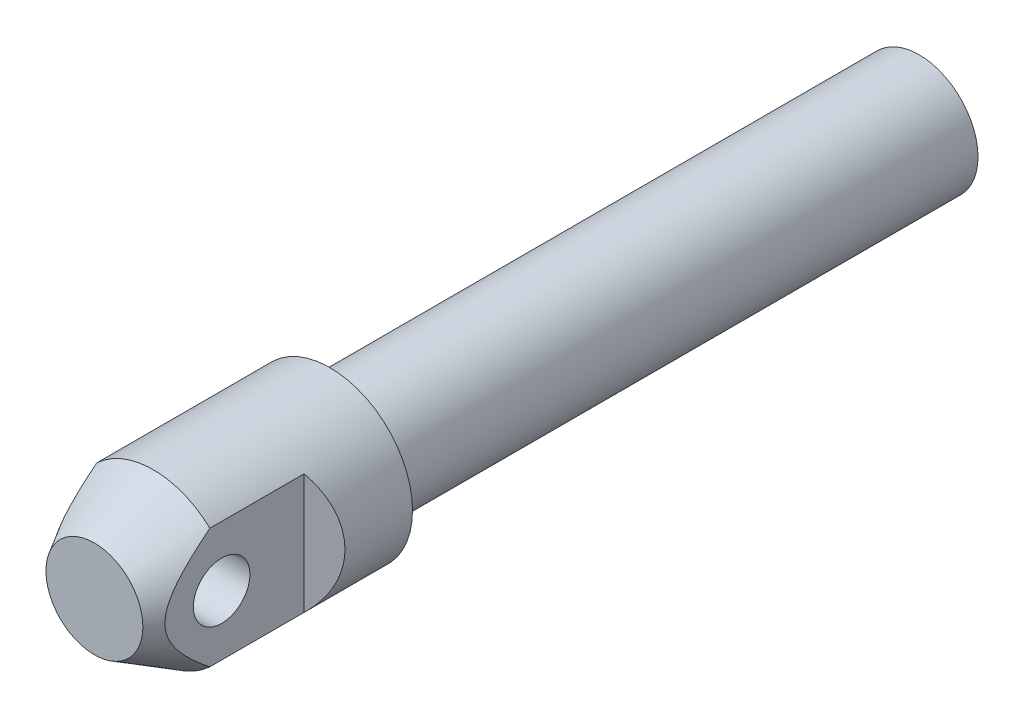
ISO-10303-21;
HEADER;
FILE_DESCRIPTION(('STEP AP214'),'2;1');
FILE_NAME('part.step','',(''),(''),'','','');
FILE_SCHEMA(('AUTOMOTIVE_DESIGN { 1 0 10303 214 1 1 1 1 }'));
ENDSEC;
DATA;
#1=APPLICATION_CONTEXT('core data for automotive mechanical design processes');
#2=APPLICATION_PROTOCOL_DEFINITION('international standard','automotive_design',2000,#1);
#3=PRODUCT_CONTEXT('',#1,'mechanical');
#4=PRODUCT('Part','Part','',(#3));
#5=PRODUCT_RELATED_PRODUCT_CATEGORY('part','',(#4));
#6=PRODUCT_DEFINITION_FORMATION('','',#4);
#7=PRODUCT_DEFINITION_CONTEXT('part definition',#1,'design');
#8=PRODUCT_DEFINITION('design','',#6,#7);
#9=PRODUCT_DEFINITION_SHAPE('','',#8);
#10=(LENGTH_UNIT() NAMED_UNIT(*) SI_UNIT(.MILLI.,.METRE.));
#11=(NAMED_UNIT(*) PLANE_ANGLE_UNIT() SI_UNIT($,.RADIAN.));
#12=(NAMED_UNIT(*) SI_UNIT($,.STERADIAN.) SOLID_ANGLE_UNIT());
#13=UNCERTAINTY_MEASURE_WITH_UNIT(LENGTH_MEASURE(1.E-05),#10,'distance_accuracy_value','');
#14=(GEOMETRIC_REPRESENTATION_CONTEXT(3) GLOBAL_UNCERTAINTY_ASSIGNED_CONTEXT((#13)) GLOBAL_UNIT_ASSIGNED_CONTEXT((#10,
#11,#12)) REPRESENTATION_CONTEXT('',''));
#15=CARTESIAN_POINT('',(0.,0.,0.));
#16=DIRECTION('',(0.,0.,1.));
#17=DIRECTION('',(1.,0.,0.));
#18=AXIS2_PLACEMENT_3D('',#15,#16,#17);
#19=CARTESIAN_POINT('',(0.,0.,20.));
#20=DIRECTION('',(0.,0.,1.));
#21=DIRECTION('',(1.,0.,0.));
#22=AXIS2_PLACEMENT_3D('',#19,#20,#21);
#23=CYLINDRICAL_SURFACE('',#22,3.5);
#24=CARTESIAN_POINT('',(0.,0.,0.));
#25=DIRECTION('',(0.,0.,1.));
#26=DIRECTION('',(1.,0.,0.));
#27=AXIS2_PLACEMENT_3D('',#24,#25,#26);
#28=CIRCLE('',#27,3.5);
#29=CARTESIAN_POINT('',(3.5,0.,0.));
#30=VERTEX_POINT('',#29);
#31=EDGE_CURVE('E82',#30,#30,#28,.T.);
#32=ORIENTED_EDGE('',*,*,#31,.T.);
#33=EDGE_LOOP('',(#32));
#34=FACE_BOUND('',#33,.T.);
#35=CARTESIAN_POINT('',(0.,0.,7.5));
#36=DIRECTION('',(0.,0.,1.));
#37=DIRECTION('',(1.,0.,0.));
#38=AXIS2_PLACEMENT_3D('',#35,#36,#37);
#39=CIRCLE('',#38,3.5);
#40=CARTESIAN_POINT('',(-2.4,-2.5475478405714,7.5));
#41=VERTEX_POINT('',#40);
#42=CARTESIAN_POINT('',(2.4,-2.54754784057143,7.5));
#43=VERTEX_POINT('',#42);
#44=EDGE_CURVE('E67',#41,#43,#39,.T.);
#45=ORIENTED_EDGE('',*,*,#44,.F.);
#46=DIRECTION('',(0.,0.,1.));
#47=VECTOR('',#46,1.);
#48=CARTESIAN_POINT('',(-2.4,-2.5475478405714,20.));
#49=LINE('',#48,#47);
#50=CARTESIAN_POINT('',(-2.4,-2.5475478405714,3.5));
#51=VERTEX_POINT('',#50);
#52=EDGE_CURVE('E30',#41,#51,#49,.F.);
#53=ORIENTED_EDGE('',*,*,#52,.T.);
#54=CARTESIAN_POINT('',(0.,0.,4.8856406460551));
#55=DIRECTION('',(0.5,0.,-0.866025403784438));
#56=DIRECTION('',(0.866025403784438,0.,0.5));
#57=AXIS2_PLACEMENT_3D('',#54,#55,#56);
#58=ELLIPSE('',#57,4.04145188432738,3.5);
#59=CARTESIAN_POINT('',(-2.4,2.5475478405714,3.5));
#60=VERTEX_POINT('',#59);
#61=EDGE_CURVE('E9',#60,#51,#58,.F.);
#62=ORIENTED_EDGE('',*,*,#61,.F.);
#63=DIRECTION('',(0.,0.,1.));
#64=VECTOR('',#63,1.);
#65=CARTESIAN_POINT('',(-2.4,2.5475478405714,20.));
#66=LINE('',#65,#64);
#67=CARTESIAN_POINT('',(-2.4,2.5475478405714,7.5));
#68=VERTEX_POINT('',#67);
#69=EDGE_CURVE('E63',#60,#68,#66,.T.);
#70=ORIENTED_EDGE('',*,*,#69,.T.);
#71=CARTESIAN_POINT('',(2.4,2.5475478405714,7.5));
#72=VERTEX_POINT('',#71);
#73=EDGE_CURVE('E79',#72,#68,#39,.T.);
#74=ORIENTED_EDGE('',*,*,#73,.F.);
#75=DIRECTION('',(0.,0.,1.));
#76=VECTOR('',#75,1.);
#77=CARTESIAN_POINT('',(2.4,2.5475478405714,20.));
#78=LINE('',#77,#76);
#79=CARTESIAN_POINT('',(2.4,2.5475478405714,3.5));
#80=VERTEX_POINT('',#79);
#81=EDGE_CURVE('E38',#80,#72,#78,.T.);
#82=ORIENTED_EDGE('',*,*,#81,.F.);
#83=CARTESIAN_POINT('',(0.,0.,4.8856406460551));
#84=DIRECTION('',(0.5,0.,0.866025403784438));
#85=DIRECTION('',(-0.866025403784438,0.,0.5));
#86=AXIS2_PLACEMENT_3D('',#83,#84,#85);
#87=ELLIPSE('',#86,4.04145188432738,3.5);
#88=CARTESIAN_POINT('',(2.4,-2.5475478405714,3.5));
#89=VERTEX_POINT('',#88);
#90=EDGE_CURVE('E99',#80,#89,#87,.F.);
#91=ORIENTED_EDGE('',*,*,#90,.T.);
#92=DIRECTION('',(0.,0.,1.));
#93=VECTOR('',#92,1.);
#94=CARTESIAN_POINT('',(2.4,-2.5475478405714,20.));
#95=LINE('',#94,#93);
#96=EDGE_CURVE('E74',#43,#89,#95,.F.);
#97=ORIENTED_EDGE('',*,*,#96,.F.);
#98=EDGE_LOOP('',(#45,#53,#62,#70,#74,#82,#91,#97));
#99=FACE_BOUND('',#98,.T.);
#100=ADVANCED_FACE('F14',(#34,#99),#23,.T.);
#101=CARTESIAN_POINT('',(0.,0.,10.));
#102=DIRECTION('',(0.,0.,-1.));
#103=DIRECTION('',(-1.,0.,0.));
#104=AXIS2_PLACEMENT_3D('',#101,#102,#103);
#105=CONICAL_SURFACE('',#104,2.05662432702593,0.523598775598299);
#106=CARTESIAN_POINT('',(0.,0.,10.));
#107=DIRECTION('',(0.,0.,1.));
#108=DIRECTION('',(1.,0.,0.));
#109=AXIS2_PLACEMENT_3D('',#106,#107,#108);
#110=CIRCLE('',#109,2.05662432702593);
#111=CARTESIAN_POINT('',(2.05662432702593,0.,10.));
#112=VERTEX_POINT('',#111);
#113=EDGE_CURVE('E76',#112,#112,#110,.T.);
#114=ORIENTED_EDGE('',*,*,#113,.F.);
#115=EDGE_LOOP('',(#114));
#116=FACE_BOUND('',#115,.T.);
#117=ORIENTED_EDGE('',*,*,#73,.T.);
#118=CARTESIAN_POINT('',(-2.4,-4.81768060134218,4.23961706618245));
#119=CARTESIAN_POINT('',(-2.4,-4.72004912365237,4.39096025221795));
#120=CARTESIAN_POINT('',(-2.4,-4.6220156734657,4.54204602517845));
#121=CARTESIAN_POINT('',(-2.4,-4.42494844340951,4.84357576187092));
#122=CARTESIAN_POINT('',(-2.4,-4.32591460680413,4.99401968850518));
#123=CARTESIAN_POINT('',(-2.4,-4.1264308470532,5.29446856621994));
#124=CARTESIAN_POINT('',(-2.4,-4.02597817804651,5.44447169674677));
#125=CARTESIAN_POINT('',(-2.4,-3.8236209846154,5.74349098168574));
#126=CARTESIAN_POINT('',(-2.4,-3.72171649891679,5.89250716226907));
#127=CARTESIAN_POINT('',(-2.4,-3.5118221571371,6.19548501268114));
#128=CARTESIAN_POINT('',(-2.4,-3.40375575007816,6.34939376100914));
#129=CARTESIAN_POINT('',(-2.4,-3.18514598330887,6.65544071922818));
#130=CARTESIAN_POINT('',(-2.4,-3.07460270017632,6.80757898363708));
#131=CARTESIAN_POINT('',(-2.4,-2.85040204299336,7.10931500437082));
#132=CARTESIAN_POINT('',(-2.4,-2.73674789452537,7.25891514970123));
#133=CARTESIAN_POINT('',(-2.4,-2.50516467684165,7.55475643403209));
#134=CARTESIAN_POINT('',(-2.4,-2.38723638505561,7.70099817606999));
#135=CARTESIAN_POINT('',(-2.4,-2.18301587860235,7.94383982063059));
#136=CARTESIAN_POINT('',(-2.4,-2.09828022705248,8.041744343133));
#137=CARTESIAN_POINT('',(-2.4,-1.92515383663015,8.23438265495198));
#138=CARTESIAN_POINT('',(-2.4,-1.8367612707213,8.3291148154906));
#139=CARTESIAN_POINT('',(-2.4,-1.65588432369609,8.51342585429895));
#140=CARTESIAN_POINT('',(-2.4,-1.56343017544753,8.60303415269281));
#141=CARTESIAN_POINT('',(-2.4,-1.3725369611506,8.775568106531));
#142=CARTESIAN_POINT('',(-2.4,-1.27410421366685,8.85850060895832));
#143=CARTESIAN_POINT('',(-2.4,-1.08897922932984,8.99916544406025));
#144=CARTESIAN_POINT('',(-2.4,-1.00365977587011,9.0586794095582));
#145=CARTESIAN_POINT('',(-2.4,-0.826783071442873,9.16783588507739));
#146=CARTESIAN_POINT('',(-2.4,-0.735228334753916,9.21748234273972));
#147=CARTESIAN_POINT('',(-2.4,-0.558924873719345,9.2961843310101));
#148=CARTESIAN_POINT('',(-2.4,-0.47505855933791,9.32716363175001));
#149=CARTESIAN_POINT('',(-2.4,-0.303337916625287,9.37473972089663));
#150=CARTESIAN_POINT('',(-2.4,-0.21549120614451,9.39136285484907));
#151=CARTESIAN_POINT('',(-2.4,-0.0374387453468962,9.40761469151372));
#152=CARTESIAN_POINT('',(-2.4,0.0527803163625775,9.40710525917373));
#153=CARTESIAN_POINT('',(-2.4,0.231391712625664,9.38884952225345));
#154=CARTESIAN_POINT('',(-2.4,0.3197831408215,9.37109486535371));
#155=CARTESIAN_POINT('',(-2.4,0.513589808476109,9.31512335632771));
#156=CARTESIAN_POINT('',(-2.4,0.617829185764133,9.2729407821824));
#157=CARTESIAN_POINT('',(-2.4,0.76836793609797,9.19821642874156));
#158=CARTESIAN_POINT('',(-2.4,0.817682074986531,9.17132621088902));
#159=CARTESIAN_POINT('',(-2.4,0.914476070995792,9.11441441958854));
#160=CARTESIAN_POINT('',(-2.4,0.961956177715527,9.08439327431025));
#161=CARTESIAN_POINT('',(-2.4,1.07399457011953,9.00921648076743));
#162=CARTESIAN_POINT('',(-2.4,1.13772527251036,8.96283685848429));
#163=CARTESIAN_POINT('',(-2.4,1.26230652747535,8.8663341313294));
#164=CARTESIAN_POINT('',(-2.4,1.32315553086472,8.81620904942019));
#165=CARTESIAN_POINT('',(-2.4,1.44249155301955,8.71302225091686));
#166=CARTESIAN_POINT('',(-2.4,1.50097400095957,8.65995528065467));
#167=CARTESIAN_POINT('',(-2.4,1.61584612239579,8.55159536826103));
#168=CARTESIAN_POINT('',(-2.4,1.67223539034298,8.49630199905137));
#169=CARTESIAN_POINT('',(-2.4,1.8401190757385,8.32643434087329));
#170=CARTESIAN_POINT('',(-2.4,1.94888412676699,8.20916125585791));
#171=CARTESIAN_POINT('',(-2.4,2.10800457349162,8.02988402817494));
#172=CARTESIAN_POINT('',(-2.4,2.16034369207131,7.96960042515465));
#173=CARTESIAN_POINT('',(-2.4,2.26388199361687,7.84806169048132));
#174=CARTESIAN_POINT('',(-2.4,2.31508121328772,7.78680659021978));
#175=CARTESIAN_POINT('',(-2.4,2.4697258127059,7.59877669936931));
#176=CARTESIAN_POINT('',(-2.4,2.57160458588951,7.47071478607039));
#177=CARTESIAN_POINT('',(-2.4,2.77224785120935,7.2121668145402));
#178=CARTESIAN_POINT('',(-2.4,2.871011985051,7.081680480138));
#179=CARTESIAN_POINT('',(-2.4,3.06614071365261,6.81885777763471));
#180=CARTESIAN_POINT('',(-2.4,3.16250443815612,6.68652076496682));
#181=CARTESIAN_POINT('',(-2.4,3.35329484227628,6.42045564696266));
#182=CARTESIAN_POINT('',(-2.4,3.44772146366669,6.28672749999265));
#183=CARTESIAN_POINT('',(-2.4,3.72906864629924,5.88335205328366));
#184=CARTESIAN_POINT('',(-2.4,3.9136472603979,5.61207251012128));
#185=CARTESIAN_POINT('',(-2.4,4.27853103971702,5.06675621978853));
#186=CARTESIAN_POINT('',(-2.4,4.45883710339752,4.79272006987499));
#187=CARTESIAN_POINT('',(-2.4,4.7987680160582,4.26980974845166));
#188=CARTESIAN_POINT('',(-2.4,4.95867811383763,4.02112069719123));
#189=CARTESIAN_POINT('',(-2.4,5.2766230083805,3.52252589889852));
#190=CARTESIAN_POINT('',(-2.4,5.43465768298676,3.27262007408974));
#191=CARTESIAN_POINT('',(-2.4,5.7486354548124,2.77288038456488));
#192=CARTESIAN_POINT('',(-2.4,5.90458436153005,2.52305016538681));
#193=CARTESIAN_POINT('',(-2.4,6.2152929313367,2.02268115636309));
#194=CARTESIAN_POINT('',(-2.4,6.37005269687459,1.77214243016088));
#195=CARTESIAN_POINT('',(-2.4,6.52436486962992,1.52133022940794));
#196=B_SPLINE_CURVE_WITH_KNOTS('',3,(#118,#119,#120,#121,#122,#123,#124,#125,#126,#127,#128,
#129,#130,#131,#132,#133,#134,#135,#136,#137,#138,#139,#140,#141,#142,#143,#144,#145,#146,#147,
#148,#149,#150,#151,#152,#153,#154,#155,#156,#157,#158,#159,#160,#161,#162,#163,#164,#165,#166,
#167,#168,#169,#170,#171,#172,#173,#174,#175,#176,#177,#178,#179,#180,#181,#182,#183,#184,#185,
#186,#187,#188,#189,#190,#191,#192,#193,#194,#195),.UNSPECIFIED.,.F.,.F.,(4,2,2,2,2,2,2,2,2,2,2,
2,2,2,2,2,2,2,2,2,2,2,2,2,2,2,2,2,2,2,2,2,2,2,2,2,2,2,4),(0.,0.540307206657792,1.08064523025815,
1.62223321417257,2.16380677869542,2.72796581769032,3.29210743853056,3.85568475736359,
4.41916007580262,4.80754000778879,5.19611637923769,5.58217431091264,5.96783110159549,
6.27946641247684,6.59097679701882,6.8582080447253,7.12494783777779,7.39383879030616,
7.66286003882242,7.99820889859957,8.16664490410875,8.33505790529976,8.57133254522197,
8.80773279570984,9.04456973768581,9.28145232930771,9.76101487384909,10.0005123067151,
10.2400020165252,10.7308602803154,11.2217748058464,11.7128647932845,12.2039695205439,
13.1882562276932,14.1723340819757,15.0593163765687,15.9463561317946,16.8298778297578,
17.7133225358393),.UNSPECIFIED.);
#197=EDGE_CURVE('E23',#68,#41,#196,.F.);
#198=ORIENTED_EDGE('',*,*,#197,.T.);
#199=ORIENTED_EDGE('',*,*,#44,.T.);
#200=CARTESIAN_POINT('',(2.4,-4.81768060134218,4.23961706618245));
#201=CARTESIAN_POINT('',(2.4,-4.72004912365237,4.39096025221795));
#202=CARTESIAN_POINT('',(2.4,-4.6220156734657,4.54204602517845));
#203=CARTESIAN_POINT('',(2.4,-4.42494844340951,4.84357576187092));
#204=CARTESIAN_POINT('',(2.4,-4.32591460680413,4.99401968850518));
#205=CARTESIAN_POINT('',(2.4,-4.1264308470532,5.29446856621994));
#206=CARTESIAN_POINT('',(2.4,-4.02597817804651,5.44447169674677));
#207=CARTESIAN_POINT('',(2.4,-3.8236209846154,5.74349098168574));
#208=CARTESIAN_POINT('',(2.4,-3.72171649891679,5.89250716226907));
#209=CARTESIAN_POINT('',(2.4,-3.5118221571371,6.19548501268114));
#210=CARTESIAN_POINT('',(2.4,-3.40375575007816,6.34939376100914));
#211=CARTESIAN_POINT('',(2.4,-3.18514598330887,6.65544071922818));
#212=CARTESIAN_POINT('',(2.4,-3.07460270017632,6.80757898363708));
#213=CARTESIAN_POINT('',(2.4,-2.85040204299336,7.10931500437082));
#214=CARTESIAN_POINT('',(2.4,-2.73674789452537,7.25891514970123));
#215=CARTESIAN_POINT('',(2.4,-2.50516467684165,7.55475643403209));
#216=CARTESIAN_POINT('',(2.4,-2.38723638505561,7.70099817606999));
#217=CARTESIAN_POINT('',(2.4,-2.18301587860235,7.94383982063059));
#218=CARTESIAN_POINT('',(2.4,-2.09828022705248,8.041744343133));
#219=CARTESIAN_POINT('',(2.4,-1.92515383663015,8.23438265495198));
#220=CARTESIAN_POINT('',(2.4,-1.8367612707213,8.3291148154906));
#221=CARTESIAN_POINT('',(2.4,-1.65588432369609,8.51342585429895));
#222=CARTESIAN_POINT('',(2.4,-1.56343017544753,8.60303415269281));
#223=CARTESIAN_POINT('',(2.4,-1.3725369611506,8.775568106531));
#224=CARTESIAN_POINT('',(2.4,-1.27410421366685,8.85850060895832));
#225=CARTESIAN_POINT('',(2.4,-1.08897922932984,8.99916544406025));
#226=CARTESIAN_POINT('',(2.4,-1.00365977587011,9.0586794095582));
#227=CARTESIAN_POINT('',(2.4,-0.826783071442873,9.16783588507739));
#228=CARTESIAN_POINT('',(2.4,-0.735228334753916,9.21748234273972));
#229=CARTESIAN_POINT('',(2.4,-0.558924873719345,9.2961843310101));
#230=CARTESIAN_POINT('',(2.4,-0.47505855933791,9.32716363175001));
#231=CARTESIAN_POINT('',(2.4,-0.303337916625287,9.37473972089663));
#232=CARTESIAN_POINT('',(2.4,-0.21549120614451,9.39136285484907));
#233=CARTESIAN_POINT('',(2.4,-0.0374387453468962,9.40761469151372));
#234=CARTESIAN_POINT('',(2.4,0.0527803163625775,9.40710525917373));
#235=CARTESIAN_POINT('',(2.4,0.231391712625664,9.38884952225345));
#236=CARTESIAN_POINT('',(2.4,0.3197831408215,9.37109486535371));
#237=CARTESIAN_POINT('',(2.4,0.513589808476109,9.31512335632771));
#238=CARTESIAN_POINT('',(2.4,0.617829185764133,9.2729407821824));
#239=CARTESIAN_POINT('',(2.4,0.76836793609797,9.19821642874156));
#240=CARTESIAN_POINT('',(2.4,0.817682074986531,9.17132621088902));
#241=CARTESIAN_POINT('',(2.4,0.914476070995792,9.11441441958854));
#242=CARTESIAN_POINT('',(2.4,0.961956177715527,9.08439327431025));
#243=CARTESIAN_POINT('',(2.4,1.07399457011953,9.00921648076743));
#244=CARTESIAN_POINT('',(2.4,1.13772527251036,8.96283685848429));
#245=CARTESIAN_POINT('',(2.4,1.26230652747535,8.8663341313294));
#246=CARTESIAN_POINT('',(2.4,1.32315553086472,8.81620904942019));
#247=CARTESIAN_POINT('',(2.4,1.44249155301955,8.71302225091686));
#248=CARTESIAN_POINT('',(2.4,1.50097400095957,8.65995528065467));
#249=CARTESIAN_POINT('',(2.4,1.61584612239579,8.55159536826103));
#250=CARTESIAN_POINT('',(2.4,1.67223539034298,8.49630199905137));
#251=CARTESIAN_POINT('',(2.4,1.8401190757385,8.32643434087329));
#252=CARTESIAN_POINT('',(2.4,1.94888412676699,8.20916125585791));
#253=CARTESIAN_POINT('',(2.4,2.10800457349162,8.02988402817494));
#254=CARTESIAN_POINT('',(2.4,2.16034369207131,7.96960042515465));
#255=CARTESIAN_POINT('',(2.4,2.26388199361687,7.84806169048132));
#256=CARTESIAN_POINT('',(2.4,2.31508121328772,7.78680659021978));
#257=CARTESIAN_POINT('',(2.4,2.4697258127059,7.59877669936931));
#258=CARTESIAN_POINT('',(2.4,2.57160458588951,7.47071478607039));
#259=CARTESIAN_POINT('',(2.4,2.77224785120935,7.2121668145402));
#260=CARTESIAN_POINT('',(2.4,2.871011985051,7.081680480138));
#261=CARTESIAN_POINT('',(2.4,3.06614071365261,6.81885777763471));
#262=CARTESIAN_POINT('',(2.4,3.16250443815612,6.68652076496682));
#263=CARTESIAN_POINT('',(2.4,3.35329484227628,6.42045564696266));
#264=CARTESIAN_POINT('',(2.4,3.44772146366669,6.28672749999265));
#265=CARTESIAN_POINT('',(2.4,3.72906864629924,5.88335205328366));
#266=CARTESIAN_POINT('',(2.4,3.9136472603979,5.61207251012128));
#267=CARTESIAN_POINT('',(2.4,4.27853103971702,5.06675621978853));
#268=CARTESIAN_POINT('',(2.4,4.45883710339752,4.79272006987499));
#269=CARTESIAN_POINT('',(2.4,4.7987680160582,4.26980974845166));
#270=CARTESIAN_POINT('',(2.4,4.95867811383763,4.02112069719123));
#271=CARTESIAN_POINT('',(2.4,5.2766230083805,3.52252589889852));
#272=CARTESIAN_POINT('',(2.4,5.43465768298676,3.27262007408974));
#273=CARTESIAN_POINT('',(2.4,5.7486354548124,2.77288038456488));
#274=CARTESIAN_POINT('',(2.4,5.90458436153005,2.52305016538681));
#275=CARTESIAN_POINT('',(2.4,6.2152929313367,2.02268115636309));
#276=CARTESIAN_POINT('',(2.4,6.37005269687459,1.77214243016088));
#277=CARTESIAN_POINT('',(2.4,6.52436486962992,1.52133022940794));
#278=B_SPLINE_CURVE_WITH_KNOTS('',3,(#200,#201,#202,#203,#204,#205,#206,#207,#208,#209,#210,
#211,#212,#213,#214,#215,#216,#217,#218,#219,#220,#221,#222,#223,#224,#225,#226,#227,#228,#229,
#230,#231,#232,#233,#234,#235,#236,#237,#238,#239,#240,#241,#242,#243,#244,#245,#246,#247,#248,
#249,#250,#251,#252,#253,#254,#255,#256,#257,#258,#259,#260,#261,#262,#263,#264,#265,#266,#267,
#268,#269,#270,#271,#272,#273,#274,#275,#276,#277),.UNSPECIFIED.,.F.,.F.,(4,2,2,2,2,2,2,2,2,2,2,
2,2,2,2,2,2,2,2,2,2,2,2,2,2,2,2,2,2,2,2,2,2,2,2,2,2,2,4),(0.,0.540307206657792,1.08064523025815,
1.62223321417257,2.16380677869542,2.72796581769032,3.29210743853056,3.85568475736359,
4.41916007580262,4.80754000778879,5.19611637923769,5.58217431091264,5.96783110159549,
6.27946641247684,6.59097679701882,6.8582080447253,7.12494783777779,7.39383879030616,
7.66286003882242,7.99820889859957,8.16664490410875,8.33505790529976,8.57133254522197,
8.80773279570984,9.04456973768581,9.28145232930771,9.76101487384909,10.0005123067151,
10.2400020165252,10.7308602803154,11.2217748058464,11.7128647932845,12.2039695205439,
13.1882562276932,14.1723340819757,15.0593163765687,15.9463561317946,16.8298778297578,
17.7133225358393),.UNSPECIFIED.);
#279=EDGE_CURVE('E91',#72,#43,#278,.F.);
#280=ORIENTED_EDGE('',*,*,#279,.F.);
#281=EDGE_LOOP('',(#117,#198,#199,#280));
#282=FACE_BOUND('',#281,.T.);
#283=ADVANCED_FACE('F104',(#116,#282),#105,.T.);
#284=CARTESIAN_POINT('',(0.,2.05662432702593,10.));
#285=DIRECTION('',(0.,0.,-1.));
#286=DIRECTION('',(-1.,0.,0.));
#287=AXIS2_PLACEMENT_3D('',#284,#285,#286);
#288=PLANE('',#287);
#289=ORIENTED_EDGE('',*,*,#113,.T.);
#290=EDGE_LOOP('',(#289));
#291=FACE_BOUND('',#290,.T.);
#292=ADVANCED_FACE('F16',(#291),#288,.F.);
#293=CARTESIAN_POINT('',(0.,2.5,-25.));
#294=DIRECTION('',(0.,0.,-1.));
#295=DIRECTION('',(-1.,0.,0.));
#296=AXIS2_PLACEMENT_3D('',#293,#294,#295);
#297=PLANE('',#296);
#298=CARTESIAN_POINT('',(0.,0.,-25.));
#299=DIRECTION('',(0.,0.,1.));
#300=DIRECTION('',(1.,0.,0.));
#301=AXIS2_PLACEMENT_3D('',#298,#299,#300);
#302=CIRCLE('',#301,2.5);
#303=CARTESIAN_POINT('',(2.5,0.,-25.));
#304=VERTEX_POINT('',#303);
#305=EDGE_CURVE('E88',#304,#304,#302,.T.);
#306=ORIENTED_EDGE('',*,*,#305,.F.);
#307=EDGE_LOOP('',(#306));
#308=FACE_BOUND('',#307,.T.);
#309=ADVANCED_FACE('F147',(#308),#297,.T.);
#310=CARTESIAN_POINT('',(0.,0.,20.));
#311=DIRECTION('',(0.,0.,1.));
#312=DIRECTION('',(1.,0.,0.));
#313=AXIS2_PLACEMENT_3D('',#310,#311,#312);
#314=CYLINDRICAL_SURFACE('',#313,2.5);
#315=ORIENTED_EDGE('',*,*,#305,.T.);
#316=EDGE_LOOP('',(#315));
#317=FACE_BOUND('',#316,.T.);
#318=CARTESIAN_POINT('',(0.,0.,0.));
#319=DIRECTION('',(0.,0.,1.));
#320=DIRECTION('',(1.,0.,0.));
#321=AXIS2_PLACEMENT_3D('',#318,#319,#320);
#322=CIRCLE('',#321,2.5);
#323=CARTESIAN_POINT('',(2.5,0.,0.));
#324=VERTEX_POINT('',#323);
#325=EDGE_CURVE('E85',#324,#324,#322,.T.);
#326=ORIENTED_EDGE('',*,*,#325,.F.);
#327=EDGE_LOOP('',(#326));
#328=FACE_BOUND('',#327,.T.);
#329=ADVANCED_FACE('F134',(#317,#328),#314,.T.);
#330=CARTESIAN_POINT('',(0.,2.5,0.));
#331=DIRECTION('',(0.,0.,1.));
#332=DIRECTION('',(1.,0.,0.));
#333=AXIS2_PLACEMENT_3D('',#330,#331,#332);
#334=PLANE('',#333);
#335=ORIENTED_EDGE('',*,*,#31,.F.);
#336=EDGE_LOOP('',(#335));
#337=FACE_BOUND('',#336,.T.);
#338=ORIENTED_EDGE('',*,*,#325,.T.);
#339=EDGE_LOOP('',(#338));
#340=FACE_BOUND('',#339,.T.);
#341=ADVANCED_FACE('F125',(#337,#340),#334,.F.);
#342=CARTESIAN_POINT('',(2.4,-15.,3.5));
#343=DIRECTION('',(0.5,0.,0.866025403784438));
#344=DIRECTION('',(0.866025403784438,0.,-0.5));
#345=AXIS2_PLACEMENT_3D('',#342,#343,#344);
#346=PLANE('',#345);
#347=DIRECTION('',(0.,1.,0.));
#348=VECTOR('',#347,1.);
#349=CARTESIAN_POINT('',(2.4,-15.,3.5));
#350=LINE('',#349,#348);
#351=EDGE_CURVE('E68',#89,#80,#350,.T.);
#352=ORIENTED_EDGE('',*,*,#351,.F.);
#353=ORIENTED_EDGE('',*,*,#90,.F.);
#354=EDGE_LOOP('',(#352,#353));
#355=FACE_BOUND('',#354,.T.);
#356=ADVANCED_FACE('F123',(#355),#346,.T.);
#357=CARTESIAN_POINT('',(2.4,-15.,3.5));
#358=DIRECTION('',(-1.,0.,0.));
#359=DIRECTION('',(0.,0.,1.));
#360=AXIS2_PLACEMENT_3D('',#357,#358,#359);
#361=PLANE('',#360);
#362=CARTESIAN_POINT('',(2.4,0.,7.));
#363=DIRECTION('',(1.,0.,0.));
#364=DIRECTION('',(0.,0.,-1.));
#365=AXIS2_PLACEMENT_3D('',#362,#363,#364);
#366=CIRCLE('',#365,1.2);
#367=CARTESIAN_POINT('',(2.4,0.,5.8));
#368=VERTEX_POINT('',#367);
#369=EDGE_CURVE('E233',#368,#368,#366,.T.);
#370=ORIENTED_EDGE('',*,*,#369,.F.);
#371=EDGE_LOOP('',(#370));
#372=FACE_BOUND('',#371,.T.);
#373=ORIENTED_EDGE('',*,*,#96,.T.);
#374=ORIENTED_EDGE('',*,*,#351,.T.);
#375=ORIENTED_EDGE('',*,*,#81,.T.);
#376=ORIENTED_EDGE('',*,*,#279,.T.);
#377=EDGE_LOOP('',(#373,#374,#375,#376));
#378=FACE_BOUND('',#377,.T.);
#379=ADVANCED_FACE('F101',(#372,#378),#361,.F.);
#380=CARTESIAN_POINT('',(-2.4,-15.,3.5));
#381=DIRECTION('',(-1.,0.,0.));
#382=DIRECTION('',(0.,0.,1.));
#383=AXIS2_PLACEMENT_3D('',#380,#381,#382);
#384=PLANE('',#383);
#385=CARTESIAN_POINT('',(-2.4,0.,7.));
#386=DIRECTION('',(-1.,0.,0.));
#387=DIRECTION('',(0.,0.,1.));
#388=AXIS2_PLACEMENT_3D('',#385,#386,#387);
#389=CIRCLE('',#388,1.2);
#390=CARTESIAN_POINT('',(-2.4,0.,8.2));
#391=VERTEX_POINT('',#390);
#392=EDGE_CURVE('E18',#391,#391,#389,.T.);
#393=ORIENTED_EDGE('',*,*,#392,.F.);
#394=EDGE_LOOP('',(#393));
#395=FACE_BOUND('',#394,.T.);
#396=ORIENTED_EDGE('',*,*,#197,.F.);
#397=ORIENTED_EDGE('',*,*,#69,.F.);
#398=DIRECTION('',(0.,1.,0.));
#399=VECTOR('',#398,1.);
#400=CARTESIAN_POINT('',(-2.4,-15.,3.5));
#401=LINE('',#400,#399);
#402=EDGE_CURVE('E59',#51,#60,#401,.T.);
#403=ORIENTED_EDGE('',*,*,#402,.F.);
#404=ORIENTED_EDGE('',*,*,#52,.F.);
#405=EDGE_LOOP('',(#396,#397,#403,#404));
#406=FACE_BOUND('',#405,.T.);
#407=ADVANCED_FACE('F62',(#395,#406),#384,.T.);
#408=CARTESIAN_POINT('',(-2.4,-15.,3.5));
#409=DIRECTION('',(0.5,0.,-0.866025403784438));
#410=DIRECTION('',(-0.866025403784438,0.,-0.5));
#411=AXIS2_PLACEMENT_3D('',#408,#409,#410);
#412=PLANE('',#411);
#413=ORIENTED_EDGE('',*,*,#61,.T.);
#414=ORIENTED_EDGE('',*,*,#402,.T.);
#415=EDGE_LOOP('',(#413,#414));
#416=FACE_BOUND('',#415,.T.);
#417=ADVANCED_FACE('F58',(#416),#412,.F.);
#418=CARTESIAN_POINT('',(-3.5,0.,7.));
#419=DIRECTION('',(1.,0.,0.));
#420=DIRECTION('',(0.,0.,-1.));
#421=AXIS2_PLACEMENT_3D('',#418,#419,#420);
#422=CYLINDRICAL_SURFACE('',#421,1.2);
#423=ORIENTED_EDGE('',*,*,#392,.T.);
#424=EDGE_LOOP('',(#423));
#425=FACE_BOUND('',#424,.T.);
#426=ORIENTED_EDGE('',*,*,#369,.T.);
#427=EDGE_LOOP('',(#426));
#428=FACE_BOUND('',#427,.T.);
#429=ADVANCED_FACE('F121',(#425,#428),#422,.F.);
#430=CLOSED_SHELL('',(#100,#283,#292,#309,#329,#341,#356,#379,#407,#417,#429));
#431=MANIFOLD_SOLID_BREP('B1',#430);
#432=ADVANCED_BREP_SHAPE_REPRESENTATION('',(#18,#431),#14);
#433=SHAPE_DEFINITION_REPRESENTATION(#9,#432);
ENDSEC;
END-ISO-10303-21;
